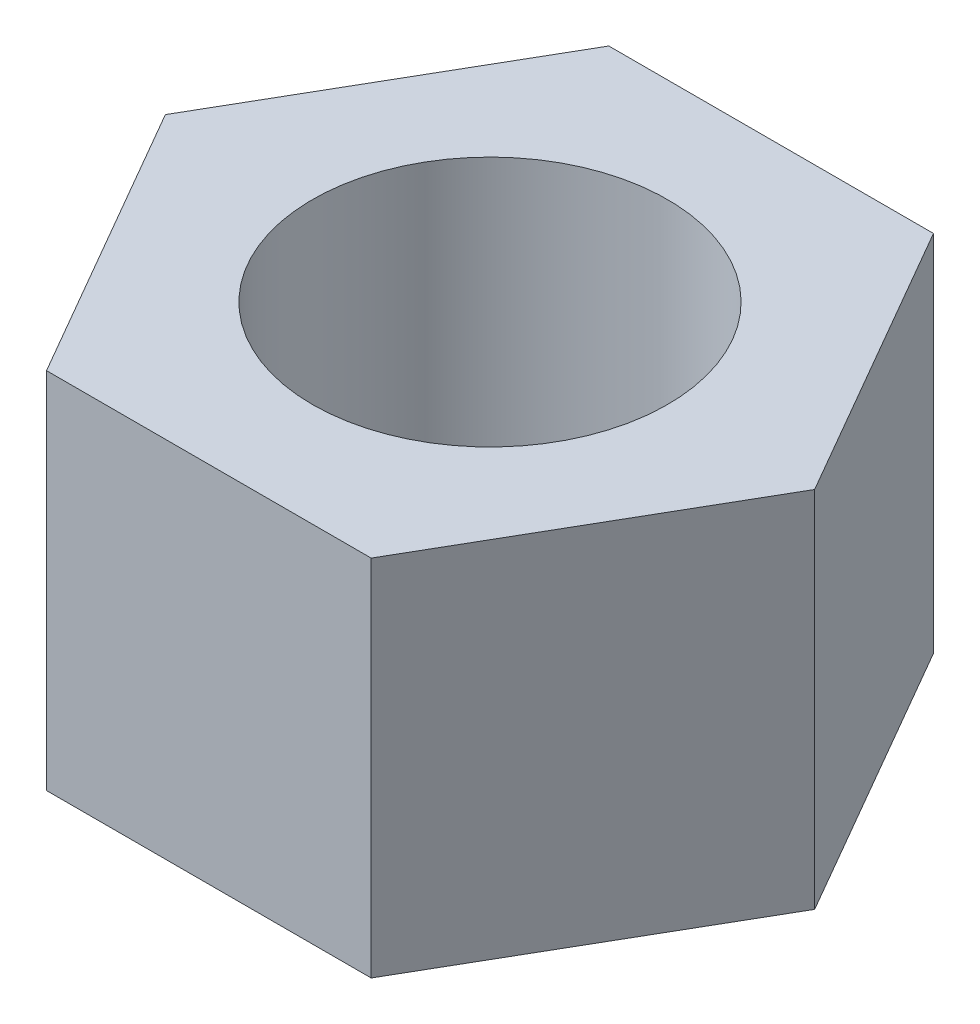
ISO-10303-21;
HEADER;
FILE_DESCRIPTION(('STEP AP214'),'2;1');
FILE_NAME('part.step','',(''),(''),'','','');
FILE_SCHEMA(('AUTOMOTIVE_DESIGN { 1 0 10303 214 1 1 1 1 }'));
ENDSEC;
DATA;
#1=APPLICATION_CONTEXT('core data for automotive mechanical design processes');
#2=APPLICATION_PROTOCOL_DEFINITION('international standard','automotive_design',2000,#1);
#3=PRODUCT_CONTEXT('',#1,'mechanical');
#4=PRODUCT('Part','Part','',(#3));
#5=PRODUCT_RELATED_PRODUCT_CATEGORY('part','',(#4));
#6=PRODUCT_DEFINITION_FORMATION('','',#4);
#7=PRODUCT_DEFINITION_CONTEXT('part definition',#1,'design');
#8=PRODUCT_DEFINITION('design','',#6,#7);
#9=PRODUCT_DEFINITION_SHAPE('','',#8);
#10=(LENGTH_UNIT() NAMED_UNIT(*) SI_UNIT(.MILLI.,.METRE.));
#11=(NAMED_UNIT(*) PLANE_ANGLE_UNIT() SI_UNIT($,.RADIAN.));
#12=(NAMED_UNIT(*) SI_UNIT($,.STERADIAN.) SOLID_ANGLE_UNIT());
#13=UNCERTAINTY_MEASURE_WITH_UNIT(LENGTH_MEASURE(1.E-05),#10,'distance_accuracy_value','');
#14=(GEOMETRIC_REPRESENTATION_CONTEXT(3) GLOBAL_UNCERTAINTY_ASSIGNED_CONTEXT((#13)) GLOBAL_UNIT_ASSIGNED_CONTEXT((#10,
#11,#12)) REPRESENTATION_CONTEXT('',''));
#15=CARTESIAN_POINT('',(0.,0.,0.));
#16=DIRECTION('',(0.,0.,1.));
#17=DIRECTION('',(1.,0.,0.));
#18=AXIS2_PLACEMENT_3D('',#15,#16,#17);
#19=CARTESIAN_POINT('',(-17.4143274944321,39.0144,30.1625));
#20=DIRECTION('',(0.,0.,-1.));
#21=DIRECTION('',(-1.,0.,0.));
#22=AXIS2_PLACEMENT_3D('',#19,#20,#21);
#23=PLANE('',#22);
#24=DIRECTION('',(1.,0.,0.));
#25=VECTOR('',#24,1.);
#26=CARTESIAN_POINT('',(-17.4143274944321,0.,30.1625));
#27=LINE('',#26,#25);
#28=CARTESIAN_POINT('',(-17.4143274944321,0.,30.1625));
#29=VERTEX_POINT('',#28);
#30=CARTESIAN_POINT('',(17.4143274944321,0.,30.1625));
#31=VERTEX_POINT('',#30);
#32=EDGE_CURVE('E119',#29,#31,#27,.T.);
#33=ORIENTED_EDGE('',*,*,#32,.T.);
#34=DIRECTION('',(0.,-1.,0.));
#35=VECTOR('',#34,1.);
#36=CARTESIAN_POINT('',(17.4143274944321,39.0144,30.1625));
#37=LINE('',#36,#35);
#38=CARTESIAN_POINT('',(17.4143274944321,39.0144,30.1625));
#39=VERTEX_POINT('',#38);
#40=EDGE_CURVE('E11',#39,#31,#37,.T.);
#41=ORIENTED_EDGE('',*,*,#40,.F.);
#42=DIRECTION('',(1.,0.,0.));
#43=VECTOR('',#42,1.);
#44=CARTESIAN_POINT('',(-17.4143274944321,39.0144,30.1625));
#45=LINE('',#44,#43);
#46=CARTESIAN_POINT('',(-17.4143274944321,39.0144,30.1625));
#47=VERTEX_POINT('',#46);
#48=EDGE_CURVE('E130',#47,#39,#45,.T.);
#49=ORIENTED_EDGE('',*,*,#48,.F.);
#50=DIRECTION('',(0.,-1.,0.));
#51=VECTOR('',#50,1.);
#52=CARTESIAN_POINT('',(-17.4143274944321,39.0144,30.1625));
#53=LINE('',#52,#51);
#54=EDGE_CURVE('E115',#47,#29,#53,.T.);
#55=ORIENTED_EDGE('',*,*,#54,.T.);
#56=EDGE_LOOP('',(#33,#41,#49,#55));
#57=FACE_BOUND('',#56,.T.);
#58=ADVANCED_FACE('F35',(#57),#23,.F.);
#59=CARTESIAN_POINT('',(17.4143274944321,39.0144,30.1625));
#60=DIRECTION('',(-0.866025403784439,0.,-0.5));
#61=DIRECTION('',(-0.5,0.,0.866025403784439));
#62=AXIS2_PLACEMENT_3D('',#59,#60,#61);
#63=PLANE('',#62);
#64=DIRECTION('',(0.5,0.,-0.866025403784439));
#65=VECTOR('',#64,1.);
#66=CARTESIAN_POINT('',(17.4143274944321,0.,30.1625));
#67=LINE('',#66,#65);
#68=CARTESIAN_POINT('',(34.8286549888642,0.,0.));
#69=VERTEX_POINT('',#68);
#70=EDGE_CURVE('E122',#31,#69,#67,.T.);
#71=ORIENTED_EDGE('',*,*,#70,.T.);
#72=DIRECTION('',(0.,-1.,0.));
#73=VECTOR('',#72,1.);
#74=CARTESIAN_POINT('',(34.8286549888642,39.0144,0.));
#75=LINE('',#74,#73);
#76=CARTESIAN_POINT('',(34.8286549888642,39.0144,0.));
#77=VERTEX_POINT('',#76);
#78=EDGE_CURVE('E43',#77,#69,#75,.T.);
#79=ORIENTED_EDGE('',*,*,#78,.F.);
#80=DIRECTION('',(0.5,0.,-0.866025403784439));
#81=VECTOR('',#80,1.);
#82=CARTESIAN_POINT('',(17.4143274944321,39.0144,30.1625));
#83=LINE('',#82,#81);
#84=EDGE_CURVE('E88',#39,#77,#83,.T.);
#85=ORIENTED_EDGE('',*,*,#84,.F.);
#86=ORIENTED_EDGE('',*,*,#40,.T.);
#87=EDGE_LOOP('',(#71,#79,#85,#86));
#88=FACE_BOUND('',#87,.T.);
#89=ADVANCED_FACE('F155',(#88),#63,.F.);
#90=CARTESIAN_POINT('',(34.8286549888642,39.0144,0.));
#91=DIRECTION('',(-0.866025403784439,0.,0.5));
#92=DIRECTION('',(0.5,0.,0.866025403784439));
#93=AXIS2_PLACEMENT_3D('',#90,#91,#92);
#94=PLANE('',#93);
#95=DIRECTION('',(-0.5,0.,-0.866025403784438));
#96=VECTOR('',#95,1.);
#97=CARTESIAN_POINT('',(34.8286549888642,0.,0.));
#98=LINE('',#97,#96);
#99=CARTESIAN_POINT('',(17.4143274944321,0.,-30.1625));
#100=VERTEX_POINT('',#99);
#101=EDGE_CURVE('E125',#69,#100,#98,.T.);
#102=ORIENTED_EDGE('',*,*,#101,.T.);
#103=DIRECTION('',(0.,-1.,0.));
#104=VECTOR('',#103,1.);
#105=CARTESIAN_POINT('',(17.4143274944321,39.0144,-30.1625));
#106=LINE('',#105,#104);
#107=CARTESIAN_POINT('',(17.4143274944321,39.0144,-30.1625));
#108=VERTEX_POINT('',#107);
#109=EDGE_CURVE('E110',#108,#100,#106,.T.);
#110=ORIENTED_EDGE('',*,*,#109,.F.);
#111=DIRECTION('',(-0.5,0.,-0.866025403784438));
#112=VECTOR('',#111,1.);
#113=CARTESIAN_POINT('',(34.8286549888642,39.0144,0.));
#114=LINE('',#113,#112);
#115=EDGE_CURVE('E101',#77,#108,#114,.T.);
#116=ORIENTED_EDGE('',*,*,#115,.F.);
#117=ORIENTED_EDGE('',*,*,#78,.T.);
#118=EDGE_LOOP('',(#102,#110,#116,#117));
#119=FACE_BOUND('',#118,.T.);
#120=ADVANCED_FACE('F136',(#119),#94,.F.);
#121=CARTESIAN_POINT('',(17.4143274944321,39.0144,-30.1625));
#122=DIRECTION('',(0.,0.,1.));
#123=DIRECTION('',(1.,0.,0.));
#124=AXIS2_PLACEMENT_3D('',#121,#122,#123);
#125=PLANE('',#124);
#126=DIRECTION('',(-1.,0.,0.));
#127=VECTOR('',#126,1.);
#128=CARTESIAN_POINT('',(17.4143274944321,0.,-30.1625));
#129=LINE('',#128,#127);
#130=CARTESIAN_POINT('',(-17.4143274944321,0.,-30.1625));
#131=VERTEX_POINT('',#130);
#132=EDGE_CURVE('E109',#100,#131,#129,.T.);
#133=ORIENTED_EDGE('',*,*,#132,.T.);
#134=DIRECTION('',(0.,-1.,0.));
#135=VECTOR('',#134,1.);
#136=CARTESIAN_POINT('',(-17.4143274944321,39.0144,-30.1625));
#137=LINE('',#136,#135);
#138=CARTESIAN_POINT('',(-17.4143274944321,39.0144,-30.1625));
#139=VERTEX_POINT('',#138);
#140=EDGE_CURVE('E106',#139,#131,#137,.T.);
#141=ORIENTED_EDGE('',*,*,#140,.F.);
#142=DIRECTION('',(-1.,0.,0.));
#143=VECTOR('',#142,1.);
#144=CARTESIAN_POINT('',(17.4143274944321,39.0144,-30.1625));
#145=LINE('',#144,#143);
#146=EDGE_CURVE('E95',#108,#139,#145,.T.);
#147=ORIENTED_EDGE('',*,*,#146,.F.);
#148=ORIENTED_EDGE('',*,*,#109,.T.);
#149=EDGE_LOOP('',(#133,#141,#147,#148));
#150=FACE_BOUND('',#149,.T.);
#151=ADVANCED_FACE('F107',(#150),#125,.F.);
#152=CARTESIAN_POINT('',(-17.4143274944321,39.0144,-30.1625));
#153=DIRECTION('',(0.866025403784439,0.,0.5));
#154=DIRECTION('',(0.5,0.,-0.866025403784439));
#155=AXIS2_PLACEMENT_3D('',#152,#153,#154);
#156=PLANE('',#155);
#157=DIRECTION('',(-0.5,0.,0.866025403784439));
#158=VECTOR('',#157,1.);
#159=CARTESIAN_POINT('',(-17.4143274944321,0.,-30.1625));
#160=LINE('',#159,#158);
#161=CARTESIAN_POINT('',(-34.8286549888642,0.,0.));
#162=VERTEX_POINT('',#161);
#163=EDGE_CURVE('E74',#131,#162,#160,.T.);
#164=ORIENTED_EDGE('',*,*,#163,.T.);
#165=DIRECTION('',(0.,-1.,0.));
#166=VECTOR('',#165,1.);
#167=CARTESIAN_POINT('',(-34.8286549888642,39.0144,0.));
#168=LINE('',#167,#166);
#169=CARTESIAN_POINT('',(-34.8286549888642,39.0144,0.));
#170=VERTEX_POINT('',#169);
#171=EDGE_CURVE('E111',#170,#162,#168,.T.);
#172=ORIENTED_EDGE('',*,*,#171,.F.);
#173=DIRECTION('',(-0.5,0.,0.866025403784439));
#174=VECTOR('',#173,1.);
#175=CARTESIAN_POINT('',(-17.4143274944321,39.0144,-30.1625));
#176=LINE('',#175,#174);
#177=EDGE_CURVE('E99',#139,#170,#176,.T.);
#178=ORIENTED_EDGE('',*,*,#177,.F.);
#179=ORIENTED_EDGE('',*,*,#140,.T.);
#180=EDGE_LOOP('',(#164,#172,#178,#179));
#181=FACE_BOUND('',#180,.T.);
#182=ADVANCED_FACE('F113',(#181),#156,.F.);
#183=CARTESIAN_POINT('',(-34.8286549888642,39.0144,0.));
#184=DIRECTION('',(0.866025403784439,0.,-0.5));
#185=DIRECTION('',(-0.5,0.,-0.866025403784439));
#186=AXIS2_PLACEMENT_3D('',#183,#184,#185);
#187=PLANE('',#186);
#188=DIRECTION('',(0.5,0.,0.866025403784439));
#189=VECTOR('',#188,1.);
#190=CARTESIAN_POINT('',(-34.8286549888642,0.,0.));
#191=LINE('',#190,#189);
#192=EDGE_CURVE('E80',#162,#29,#191,.T.);
#193=ORIENTED_EDGE('',*,*,#192,.T.);
#194=ORIENTED_EDGE('',*,*,#54,.F.);
#195=DIRECTION('',(0.5,0.,0.866025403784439));
#196=VECTOR('',#195,1.);
#197=CARTESIAN_POINT('',(-34.8286549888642,39.0144,0.));
#198=LINE('',#197,#196);
#199=EDGE_CURVE('E51',#170,#47,#198,.T.);
#200=ORIENTED_EDGE('',*,*,#199,.F.);
#201=ORIENTED_EDGE('',*,*,#171,.T.);
#202=EDGE_LOOP('',(#193,#194,#200,#201));
#203=FACE_BOUND('',#202,.T.);
#204=ADVANCED_FACE('F143',(#203),#187,.F.);
#205=CARTESIAN_POINT('',(0.,39.0144,0.));
#206=DIRECTION('',(0.,1.,0.));
#207=DIRECTION('',(0.,0.,1.));
#208=AXIS2_PLACEMENT_3D('',#205,#206,#207);
#209=PLANE('',#208);
#210=CARTESIAN_POINT('',(0.,39.0144,0.));
#211=DIRECTION('',(0.,1.,0.));
#212=DIRECTION('',(0.,0.,1.));
#213=AXIS2_PLACEMENT_3D('',#210,#211,#212);
#214=CIRCLE('',#213,19.05);
#215=CARTESIAN_POINT('',(0.,39.0144,19.05));
#216=VERTEX_POINT('',#215);
#217=EDGE_CURVE('E123',#216,#216,#214,.F.);
#218=ORIENTED_EDGE('',*,*,#217,.T.);
#219=EDGE_LOOP('',(#218));
#220=FACE_BOUND('',#219,.T.);
#221=ORIENTED_EDGE('',*,*,#48,.T.);
#222=ORIENTED_EDGE('',*,*,#84,.T.);
#223=ORIENTED_EDGE('',*,*,#115,.T.);
#224=ORIENTED_EDGE('',*,*,#146,.T.);
#225=ORIENTED_EDGE('',*,*,#177,.T.);
#226=ORIENTED_EDGE('',*,*,#199,.T.);
#227=EDGE_LOOP('',(#221,#222,#223,#224,#225,#226));
#228=FACE_BOUND('',#227,.T.);
#229=ADVANCED_FACE('F97',(#220,#228),#209,.T.);
#230=CARTESIAN_POINT('',(0.,0.,0.));
#231=DIRECTION('',(0.,1.,0.));
#232=DIRECTION('',(0.,0.,1.));
#233=AXIS2_PLACEMENT_3D('',#230,#231,#232);
#234=PLANE('',#233);
#235=CARTESIAN_POINT('',(0.,0.,0.));
#236=DIRECTION('',(0.,1.,0.));
#237=DIRECTION('',(0.,0.,1.));
#238=AXIS2_PLACEMENT_3D('',#235,#236,#237);
#239=CIRCLE('',#238,19.05);
#240=CARTESIAN_POINT('',(0.,0.,19.05));
#241=VERTEX_POINT('',#240);
#242=EDGE_CURVE('E210',#241,#241,#239,.T.);
#243=ORIENTED_EDGE('',*,*,#242,.T.);
#244=EDGE_LOOP('',(#243));
#245=FACE_BOUND('',#244,.T.);
#246=ORIENTED_EDGE('',*,*,#32,.F.);
#247=ORIENTED_EDGE('',*,*,#192,.F.);
#248=ORIENTED_EDGE('',*,*,#163,.F.);
#249=ORIENTED_EDGE('',*,*,#132,.F.);
#250=ORIENTED_EDGE('',*,*,#101,.F.);
#251=ORIENTED_EDGE('',*,*,#70,.F.);
#252=EDGE_LOOP('',(#246,#247,#248,#249,#250,#251));
#253=FACE_BOUND('',#252,.T.);
#254=ADVANCED_FACE('F139',(#245,#253),#234,.F.);
#255=CARTESIAN_POINT('',(0.,101.6,0.));
#256=DIRECTION('',(0.,-1.,0.));
#257=DIRECTION('',(0.,0.,-1.));
#258=AXIS2_PLACEMENT_3D('',#255,#256,#257);
#259=CYLINDRICAL_SURFACE('',#258,19.05);
#260=ORIENTED_EDGE('',*,*,#217,.F.);
#261=EDGE_LOOP('',(#260));
#262=FACE_BOUND('',#261,.T.);
#263=ORIENTED_EDGE('',*,*,#242,.F.);
#264=EDGE_LOOP('',(#263));
#265=FACE_BOUND('',#264,.T.);
#266=ADVANCED_FACE('F192',(#262,#265),#259,.F.);
#267=CLOSED_SHELL('',(#58,#89,#120,#151,#182,#204,#229,#254,#266));
#268=MANIFOLD_SOLID_BREP('B2',#267);
#269=ADVANCED_BREP_SHAPE_REPRESENTATION('',(#18,#268),#14);
#270=SHAPE_DEFINITION_REPRESENTATION(#9,#269);
ENDSEC;
END-ISO-10303-21;
